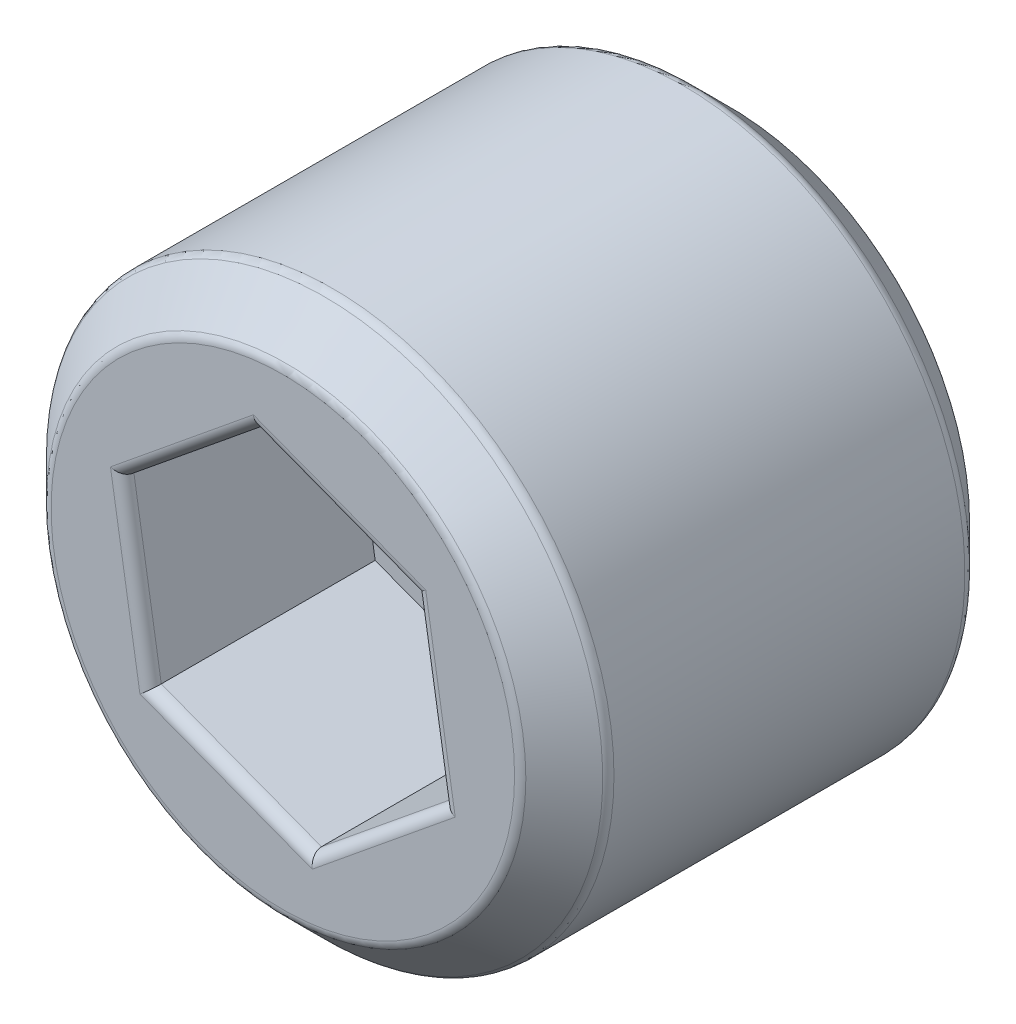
ISO-10303-21;
HEADER;
FILE_DESCRIPTION(('STEP AP214'),'2;1');
FILE_NAME('part.step','',(''),(''),'','','');
FILE_SCHEMA(('AUTOMOTIVE_DESIGN { 1 0 10303 214 1 1 1 1 }'));
ENDSEC;
DATA;
#1=APPLICATION_CONTEXT('core data for automotive mechanical design processes');
#2=APPLICATION_PROTOCOL_DEFINITION('international standard','automotive_design',2000,#1);
#3=PRODUCT_CONTEXT('',#1,'mechanical');
#4=PRODUCT('Part','Part','',(#3));
#5=PRODUCT_RELATED_PRODUCT_CATEGORY('part','',(#4));
#6=PRODUCT_DEFINITION_FORMATION('','',#4);
#7=PRODUCT_DEFINITION_CONTEXT('part definition',#1,'design');
#8=PRODUCT_DEFINITION('design','',#6,#7);
#9=PRODUCT_DEFINITION_SHAPE('','',#8);
#10=(LENGTH_UNIT() NAMED_UNIT(*) SI_UNIT(.MILLI.,.METRE.));
#11=(NAMED_UNIT(*) PLANE_ANGLE_UNIT() SI_UNIT($,.RADIAN.));
#12=(NAMED_UNIT(*) SI_UNIT($,.STERADIAN.) SOLID_ANGLE_UNIT());
#13=UNCERTAINTY_MEASURE_WITH_UNIT(LENGTH_MEASURE(1.E-05),#10,'distance_accuracy_value','');
#14=(GEOMETRIC_REPRESENTATION_CONTEXT(3) GLOBAL_UNCERTAINTY_ASSIGNED_CONTEXT((#13)) GLOBAL_UNIT_ASSIGNED_CONTEXT((#10,
#11,#12)) REPRESENTATION_CONTEXT('',''));
#15=CARTESIAN_POINT('',(0.,0.,0.));
#16=DIRECTION('',(0.,0.,1.));
#17=DIRECTION('',(1.,0.,0.));
#18=AXIS2_PLACEMENT_3D('',#15,#16,#17);
#19=CARTESIAN_POINT('',(0.,0.,4.));
#20=DIRECTION('',(0.,0.,-1.));
#21=DIRECTION('',(-1.,0.,0.));
#22=AXIS2_PLACEMENT_3D('',#19,#20,#21);
#23=CYLINDRICAL_SURFACE('',#22,2.5);
#24=CARTESIAN_POINT('',(0.,0.,3.55857864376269));
#25=DIRECTION('',(0.,0.,1.));
#26=DIRECTION('',(1.,0.,0.));
#27=AXIS2_PLACEMENT_3D('',#24,#25,#26);
#28=CIRCLE('',#27,2.5);
#29=CARTESIAN_POINT('',(2.5,0.,3.55857864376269));
#30=VERTEX_POINT('',#29);
#31=EDGE_CURVE('E11',#30,#30,#28,.F.);
#32=ORIENTED_EDGE('',*,*,#31,.T.);
#33=EDGE_LOOP('',(#32));
#34=FACE_BOUND('',#33,.T.);
#35=CARTESIAN_POINT('',(0.,0.,0.44142135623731));
#36=DIRECTION('',(0.,0.,-1.));
#37=DIRECTION('',(-1.,0.,0.));
#38=AXIS2_PLACEMENT_3D('',#35,#36,#37);
#39=CIRCLE('',#38,2.5);
#40=CARTESIAN_POINT('',(-2.5,0.,0.44142135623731));
#41=VERTEX_POINT('',#40);
#42=EDGE_CURVE('E42',#41,#41,#39,.F.);
#43=ORIENTED_EDGE('',*,*,#42,.T.);
#44=EDGE_LOOP('',(#43));
#45=FACE_BOUND('',#44,.T.);
#46=ADVANCED_FACE('F35',(#34,#45),#23,.T.);
#47=CARTESIAN_POINT('',(0.,0.,4.));
#48=DIRECTION('',(0.,0.,1.));
#49=DIRECTION('',(1.,0.,0.));
#50=AXIS2_PLACEMENT_3D('',#47,#48,#49);
#51=PLANE('',#50);
#52=CARTESIAN_POINT('',(0.,0.,4.));
#53=DIRECTION('',(0.,0.,1.));
#54=DIRECTION('',(1.,0.,0.));
#55=AXIS2_PLACEMENT_3D('',#52,#53,#54);
#56=CIRCLE('',#55,2.05857864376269);
#57=CARTESIAN_POINT('',(2.05857864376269,0.,4.));
#58=VERTEX_POINT('',#57);
#59=EDGE_CURVE('E178',#58,#58,#56,.T.);
#60=ORIENTED_EDGE('',*,*,#59,.T.);
#61=EDGE_LOOP('',(#60));
#62=FACE_BOUND('',#61,.T.);
#63=DIRECTION('',(0.159886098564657,-0.987135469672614,0.));
#64=VECTOR('',#63,1.);
#65=CARTESIAN_POINT('',(-1.52197446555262,0.524649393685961,4.));
#66=LINE('',#65,#64);
#67=CARTESIAN_POINT('',(-1.26931922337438,-1.03524201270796,4.));
#68=VERTEX_POINT('',#67);
#69=CARTESIAN_POINT('',(-1.53120549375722,0.581641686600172,4.));
#70=VERTEX_POINT('',#69);
#71=EDGE_CURVE('E173',#68,#70,#66,.F.);
#72=ORIENTED_EDGE('',*,*,#71,.T.);
#73=DIRECTION('',(-0.774941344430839,-0.632033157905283,0.));
#74=VECTOR('',#73,1.);
#75=CARTESIAN_POINT('',(-0.306627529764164,1.58039324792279,4.));
#76=LINE('',#75,#74);
#77=CARTESIAN_POINT('',(-0.261886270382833,1.61688369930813,4.));
#78=VERTEX_POINT('',#77);
#79=EDGE_CURVE('E175',#70,#78,#76,.F.);
#80=ORIENTED_EDGE('',*,*,#79,.T.);
#81=DIRECTION('',(-0.934827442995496,0.355102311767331,0.));
#82=VECTOR('',#81,1.);
#83=CARTESIAN_POINT('',(1.21534693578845,1.05574385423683,4.));
#84=LINE('',#83,#82);
#85=CARTESIAN_POINT('',(1.26931922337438,1.03524201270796,4.));
#86=VERTEX_POINT('',#85);
#87=EDGE_CURVE('E165',#78,#86,#84,.F.);
#88=ORIENTED_EDGE('',*,*,#87,.T.);
#89=DIRECTION('',(-0.159886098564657,0.987135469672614,0.));
#90=VECTOR('',#89,1.);
#91=CARTESIAN_POINT('',(1.52197446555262,-0.524649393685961,4.));
#92=LINE('',#91,#90);
#93=CARTESIAN_POINT('',(1.53120549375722,-0.581641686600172,4.));
#94=VERTEX_POINT('',#93);
#95=EDGE_CURVE('E167',#86,#94,#92,.F.);
#96=ORIENTED_EDGE('',*,*,#95,.T.);
#97=DIRECTION('',(0.774941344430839,0.632033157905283,0.));
#98=VECTOR('',#97,1.);
#99=CARTESIAN_POINT('',(0.306627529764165,-1.58039324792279,4.));
#100=LINE('',#99,#98);
#101=CARTESIAN_POINT('',(0.261886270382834,-1.61688369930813,4.));
#102=VERTEX_POINT('',#101);
#103=EDGE_CURVE('E169',#94,#102,#100,.F.);
#104=ORIENTED_EDGE('',*,*,#103,.T.);
#105=DIRECTION('',(0.934827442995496,-0.355102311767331,0.));
#106=VECTOR('',#105,1.);
#107=CARTESIAN_POINT('',(-1.21534693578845,-1.05574385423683,4.));
#108=LINE('',#107,#106);
#109=EDGE_CURVE('E171',#102,#68,#108,.F.);
#110=ORIENTED_EDGE('',*,*,#109,.T.);
#111=EDGE_LOOP('',(#72,#80,#88,#96,#104,#110));
#112=FACE_BOUND('',#111,.T.);
#113=ADVANCED_FACE('F212',(#62,#112),#51,.T.);
#114=CARTESIAN_POINT('',(0.,0.,0.));
#115=DIRECTION('',(0.,0.,1.));
#116=DIRECTION('',(1.,0.,0.));
#117=AXIS2_PLACEMENT_3D('',#114,#115,#116);
#118=PLANE('',#117);
#119=CARTESIAN_POINT('',(0.,0.,0.));
#120=DIRECTION('',(0.,0.,1.));
#121=DIRECTION('',(1.,0.,0.));
#122=AXIS2_PLACEMENT_3D('',#119,#120,#121);
#123=CIRCLE('',#122,2.05857864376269);
#124=CARTESIAN_POINT('',(2.05857864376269,0.,0.));
#125=VERTEX_POINT('',#124);
#126=EDGE_CURVE('E148',#125,#125,#123,.F.);
#127=ORIENTED_EDGE('',*,*,#126,.T.);
#128=EDGE_LOOP('',(#127));
#129=FACE_BOUND('',#128,.T.);
#130=ADVANCED_FACE('F217',(#129),#118,.F.);
#131=CARTESIAN_POINT('',(0.,0.,0.400000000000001));
#132=DIRECTION('',(0.,0.,1.));
#133=DIRECTION('',(1.,0.,0.));
#134=AXIS2_PLACEMENT_3D('',#131,#132,#133);
#135=CONICAL_SURFACE('',#134,2.5,0.78539816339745);
#136=CARTESIAN_POINT('',(0.,0.,0.029289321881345));
#137=DIRECTION('',(0.,0.,1.));
#138=DIRECTION('',(1.,0.,0.));
#139=AXIS2_PLACEMENT_3D('',#136,#137,#138);
#140=CIRCLE('',#139,2.12928932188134);
#141=CARTESIAN_POINT('',(2.12928932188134,0.,0.029289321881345));
#142=VERTEX_POINT('',#141);
#143=EDGE_CURVE('E162',#142,#142,#140,.T.);
#144=ORIENTED_EDGE('',*,*,#143,.T.);
#145=EDGE_LOOP('',(#144));
#146=FACE_BOUND('',#145,.T.);
#147=CARTESIAN_POINT('',(0.,0.,0.370710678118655));
#148=DIRECTION('',(0.,0.,1.));
#149=DIRECTION('',(1.,0.,0.));
#150=AXIS2_PLACEMENT_3D('',#147,#148,#149);
#151=CIRCLE('',#150,2.47071067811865);
#152=CARTESIAN_POINT('',(2.47071067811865,0.,0.370710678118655));
#153=VERTEX_POINT('',#152);
#154=EDGE_CURVE('E159',#153,#153,#151,.F.);
#155=ORIENTED_EDGE('',*,*,#154,.T.);
#156=EDGE_LOOP('',(#155));
#157=FACE_BOUND('',#156,.T.);
#158=ADVANCED_FACE('F224',(#146,#157),#135,.T.);
#159=CARTESIAN_POINT('',(0.,0.,4.));
#160=DIRECTION('',(0.,0.,-1.));
#161=DIRECTION('',(-1.,0.,0.));
#162=AXIS2_PLACEMENT_3D('',#159,#160,#161);
#163=CONICAL_SURFACE('',#162,2.1,0.785398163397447);
#164=CARTESIAN_POINT('',(0.,0.,3.97071067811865));
#165=DIRECTION('',(0.,0.,1.));
#166=DIRECTION('',(1.,0.,0.));
#167=AXIS2_PLACEMENT_3D('',#164,#165,#166);
#168=CIRCLE('',#167,2.12928932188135);
#169=CARTESIAN_POINT('',(2.12928932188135,0.,3.97071067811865));
#170=VERTEX_POINT('',#169);
#171=EDGE_CURVE('E184',#170,#170,#168,.F.);
#172=ORIENTED_EDGE('',*,*,#171,.T.);
#173=EDGE_LOOP('',(#172));
#174=FACE_BOUND('',#173,.T.);
#175=CARTESIAN_POINT('',(0.,0.,3.62928932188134));
#176=DIRECTION('',(0.,0.,-1.));
#177=DIRECTION('',(-1.,0.,0.));
#178=AXIS2_PLACEMENT_3D('',#175,#176,#177);
#179=CIRCLE('',#178,2.47071067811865);
#180=CARTESIAN_POINT('',(-2.47071067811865,0.,3.62928932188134));
#181=VERTEX_POINT('',#180);
#182=EDGE_CURVE('E181',#181,#181,#179,.F.);
#183=ORIENTED_EDGE('',*,*,#182,.T.);
#184=EDGE_LOOP('',(#183));
#185=FACE_BOUND('',#184,.T.);
#186=ADVANCED_FACE('F231',(#174,#185),#163,.T.);
#187=CARTESIAN_POINT('',(1.17983670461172,0.962261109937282,2.));
#188=DIRECTION('',(0.355102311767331,0.934827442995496,0.));
#189=DIRECTION('',(-0.934827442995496,0.355102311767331,0.));
#190=AXIS2_PLACEMENT_3D('',#187,#188,#189);
#191=PLANE('',#190);
#192=DIRECTION('',(0.,0.,1.));
#193=VECTOR('',#192,1.);
#194=CARTESIAN_POINT('',(1.17983670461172,0.962261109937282,2.));
#195=LINE('',#194,#193);
#196=CARTESIAN_POINT('',(1.17983670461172,0.962261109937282,2.));
#197=VERTEX_POINT('',#196);
#198=CARTESIAN_POINT('',(1.17983670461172,0.962261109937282,3.9));
#199=VERTEX_POINT('',#198);
#200=EDGE_CURVE('E146',#197,#199,#195,.T.);
#201=ORIENTED_EDGE('',*,*,#200,.T.);
#202=DIRECTION('',(-0.934827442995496,0.355102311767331,0.));
#203=VECTOR('',#202,1.);
#204=CARTESIAN_POINT('',(-0.243424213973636,1.50289911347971,3.9));
#205=LINE('',#204,#203);
#206=CARTESIAN_POINT('',(-0.243424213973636,1.50289911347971,3.9));
#207=VERTEX_POINT('',#206);
#208=EDGE_CURVE('E113',#199,#207,#205,.T.);
#209=ORIENTED_EDGE('',*,*,#208,.T.);
#210=DIRECTION('',(0.,0.,1.));
#211=VECTOR('',#210,1.);
#212=CARTESIAN_POINT('',(-0.243424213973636,1.50289911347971,2.));
#213=LINE('',#212,#211);
#214=CARTESIAN_POINT('',(-0.243424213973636,1.50289911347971,2.));
#215=VERTEX_POINT('',#214);
#216=EDGE_CURVE('E106',#215,#207,#213,.T.);
#217=ORIENTED_EDGE('',*,*,#216,.F.);
#218=DIRECTION('',(-0.934827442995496,0.355102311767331,0.));
#219=VECTOR('',#218,1.);
#220=CARTESIAN_POINT('',(1.17983670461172,0.962261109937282,2.));
#221=LINE('',#220,#219);
#222=EDGE_CURVE('E110',#197,#215,#221,.T.);
#223=ORIENTED_EDGE('',*,*,#222,.F.);
#224=EDGE_LOOP('',(#201,#209,#217,#223));
#225=FACE_BOUND('',#224,.T.);
#226=ADVANCED_FACE('F108',(#225),#191,.F.);
#227=CARTESIAN_POINT('',(1.42326091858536,-0.540638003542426,2.));
#228=DIRECTION('',(0.987135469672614,0.159886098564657,0.));
#229=DIRECTION('',(-0.159886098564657,0.987135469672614,0.));
#230=AXIS2_PLACEMENT_3D('',#227,#228,#229);
#231=PLANE('',#230);
#232=DIRECTION('',(0.,0.,1.));
#233=VECTOR('',#232,1.);
#234=CARTESIAN_POINT('',(1.42326091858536,-0.540638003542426,2.));
#235=LINE('',#234,#233);
#236=CARTESIAN_POINT('',(1.42326091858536,-0.540638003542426,2.));
#237=VERTEX_POINT('',#236);
#238=CARTESIAN_POINT('',(1.42326091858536,-0.540638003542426,3.9));
#239=VERTEX_POINT('',#238);
#240=EDGE_CURVE('E149',#237,#239,#235,.T.);
#241=ORIENTED_EDGE('',*,*,#240,.T.);
#242=DIRECTION('',(-0.159886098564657,0.987135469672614,0.));
#243=VECTOR('',#242,1.);
#244=CARTESIAN_POINT('',(1.17983670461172,0.962261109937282,3.9));
#245=LINE('',#244,#243);
#246=EDGE_CURVE('E49',#239,#199,#245,.T.);
#247=ORIENTED_EDGE('',*,*,#246,.T.);
#248=ORIENTED_EDGE('',*,*,#200,.F.);
#249=DIRECTION('',(-0.159886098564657,0.987135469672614,0.));
#250=VECTOR('',#249,1.);
#251=CARTESIAN_POINT('',(1.42326091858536,-0.540638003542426,2.));
#252=LINE('',#251,#250);
#253=EDGE_CURVE('E118',#237,#197,#252,.T.);
#254=ORIENTED_EDGE('',*,*,#253,.F.);
#255=EDGE_LOOP('',(#241,#247,#248,#254));
#256=FACE_BOUND('',#255,.T.);
#257=ADVANCED_FACE('F238',(#256),#231,.F.);
#258=CARTESIAN_POINT('',(0.243424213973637,-1.50289911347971,2.));
#259=DIRECTION('',(0.632033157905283,-0.774941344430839,0.));
#260=DIRECTION('',(0.774941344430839,0.632033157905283,0.));
#261=AXIS2_PLACEMENT_3D('',#258,#259,#260);
#262=PLANE('',#261);
#263=DIRECTION('',(0.,0.,1.));
#264=VECTOR('',#263,1.);
#265=CARTESIAN_POINT('',(0.243424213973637,-1.50289911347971,2.));
#266=LINE('',#265,#264);
#267=CARTESIAN_POINT('',(0.243424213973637,-1.50289911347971,2.));
#268=VERTEX_POINT('',#267);
#269=CARTESIAN_POINT('',(0.243424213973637,-1.50289911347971,3.9));
#270=VERTEX_POINT('',#269);
#271=EDGE_CURVE('E151',#268,#270,#266,.T.);
#272=ORIENTED_EDGE('',*,*,#271,.T.);
#273=DIRECTION('',(0.774941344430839,0.632033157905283,0.));
#274=VECTOR('',#273,1.);
#275=CARTESIAN_POINT('',(1.42326091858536,-0.540638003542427,3.9));
#276=LINE('',#275,#274);
#277=EDGE_CURVE('E57',#270,#239,#276,.T.);
#278=ORIENTED_EDGE('',*,*,#277,.T.);
#279=ORIENTED_EDGE('',*,*,#240,.F.);
#280=DIRECTION('',(0.774941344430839,0.632033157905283,0.));
#281=VECTOR('',#280,1.);
#282=CARTESIAN_POINT('',(0.243424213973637,-1.50289911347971,2.));
#283=LINE('',#282,#281);
#284=EDGE_CURVE('E143',#268,#237,#283,.T.);
#285=ORIENTED_EDGE('',*,*,#284,.F.);
#286=EDGE_LOOP('',(#272,#278,#279,#285));
#287=FACE_BOUND('',#286,.T.);
#288=ADVANCED_FACE('F248',(#287),#262,.F.);
#289=CARTESIAN_POINT('',(-1.17983670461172,-0.962261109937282,2.));
#290=DIRECTION('',(-0.355102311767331,-0.934827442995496,0.));
#291=DIRECTION('',(0.934827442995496,-0.355102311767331,0.));
#292=AXIS2_PLACEMENT_3D('',#289,#290,#291);
#293=PLANE('',#292);
#294=DIRECTION('',(0.,0.,1.));
#295=VECTOR('',#294,1.);
#296=CARTESIAN_POINT('',(-1.17983670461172,-0.962261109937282,2.));
#297=LINE('',#296,#295);
#298=CARTESIAN_POINT('',(-1.17983670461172,-0.962261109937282,2.));
#299=VERTEX_POINT('',#298);
#300=CARTESIAN_POINT('',(-1.17983670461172,-0.962261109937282,3.9));
#301=VERTEX_POINT('',#300);
#302=EDGE_CURVE('E153',#299,#301,#297,.T.);
#303=ORIENTED_EDGE('',*,*,#302,.T.);
#304=DIRECTION('',(0.934827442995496,-0.355102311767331,0.));
#305=VECTOR('',#304,1.);
#306=CARTESIAN_POINT('',(0.243424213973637,-1.50289911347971,3.9));
#307=LINE('',#306,#305);
#308=EDGE_CURVE('E191',#301,#270,#307,.T.);
#309=ORIENTED_EDGE('',*,*,#308,.T.);
#310=ORIENTED_EDGE('',*,*,#271,.F.);
#311=DIRECTION('',(0.934827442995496,-0.355102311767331,0.));
#312=VECTOR('',#311,1.);
#313=CARTESIAN_POINT('',(-1.17983670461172,-0.962261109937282,2.));
#314=LINE('',#313,#312);
#315=EDGE_CURVE('E140',#299,#268,#314,.T.);
#316=ORIENTED_EDGE('',*,*,#315,.F.);
#317=EDGE_LOOP('',(#303,#309,#310,#316));
#318=FACE_BOUND('',#317,.T.);
#319=ADVANCED_FACE('F244',(#318),#293,.F.);
#320=CARTESIAN_POINT('',(-1.42326091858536,0.540638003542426,2.));
#321=DIRECTION('',(-0.987135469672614,-0.159886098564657,0.));
#322=DIRECTION('',(0.159886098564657,-0.987135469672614,0.));
#323=AXIS2_PLACEMENT_3D('',#320,#321,#322);
#324=PLANE('',#323);
#325=DIRECTION('',(0.,0.,1.));
#326=VECTOR('',#325,1.);
#327=CARTESIAN_POINT('',(-1.42326091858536,0.540638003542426,2.));
#328=LINE('',#327,#326);
#329=CARTESIAN_POINT('',(-1.42326091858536,0.540638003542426,2.));
#330=VERTEX_POINT('',#329);
#331=CARTESIAN_POINT('',(-1.42326091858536,0.540638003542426,3.9));
#332=VERTEX_POINT('',#331);
#333=EDGE_CURVE('E117',#330,#332,#328,.T.);
#334=ORIENTED_EDGE('',*,*,#333,.T.);
#335=DIRECTION('',(0.159886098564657,-0.987135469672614,0.));
#336=VECTOR('',#335,1.);
#337=CARTESIAN_POINT('',(-1.17983670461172,-0.962261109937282,3.9));
#338=LINE('',#337,#336);
#339=EDGE_CURVE('E189',#332,#301,#338,.T.);
#340=ORIENTED_EDGE('',*,*,#339,.T.);
#341=ORIENTED_EDGE('',*,*,#302,.F.);
#342=DIRECTION('',(0.159886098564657,-0.987135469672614,0.));
#343=VECTOR('',#342,1.);
#344=CARTESIAN_POINT('',(-1.42326091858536,0.540638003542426,2.));
#345=LINE('',#344,#343);
#346=EDGE_CURVE('E127',#330,#299,#345,.T.);
#347=ORIENTED_EDGE('',*,*,#346,.F.);
#348=EDGE_LOOP('',(#334,#340,#341,#347));
#349=FACE_BOUND('',#348,.T.);
#350=ADVANCED_FACE('F241',(#349),#324,.F.);
#351=CARTESIAN_POINT('',(-0.243424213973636,1.50289911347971,2.));
#352=DIRECTION('',(-0.632033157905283,0.774941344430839,0.));
#353=DIRECTION('',(-0.774941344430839,-0.632033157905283,0.));
#354=AXIS2_PLACEMENT_3D('',#351,#352,#353);
#355=PLANE('',#354);
#356=ORIENTED_EDGE('',*,*,#216,.T.);
#357=DIRECTION('',(-0.774941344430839,-0.632033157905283,0.));
#358=VECTOR('',#357,1.);
#359=CARTESIAN_POINT('',(-1.42326091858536,0.540638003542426,3.9));
#360=LINE('',#359,#358);
#361=EDGE_CURVE('E187',#207,#332,#360,.T.);
#362=ORIENTED_EDGE('',*,*,#361,.T.);
#363=ORIENTED_EDGE('',*,*,#333,.F.);
#364=DIRECTION('',(-0.774941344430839,-0.632033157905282,0.));
#365=VECTOR('',#364,1.);
#366=CARTESIAN_POINT('',(-0.243424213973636,1.50289911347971,2.));
#367=LINE('',#366,#365);
#368=EDGE_CURVE('E121',#215,#330,#367,.T.);
#369=ORIENTED_EDGE('',*,*,#368,.F.);
#370=EDGE_LOOP('',(#356,#362,#363,#369));
#371=FACE_BOUND('',#370,.T.);
#372=ADVANCED_FACE('F122',(#371),#355,.F.);
#373=CARTESIAN_POINT('',(1.17983670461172,0.962261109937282,2.));
#374=DIRECTION('',(0.,0.,-1.));
#375=DIRECTION('',(-1.,0.,0.));
#376=AXIS2_PLACEMENT_3D('',#373,#374,#375);
#377=PLANE('',#376);
#378=ORIENTED_EDGE('',*,*,#222,.T.);
#379=ORIENTED_EDGE('',*,*,#368,.T.);
#380=ORIENTED_EDGE('',*,*,#346,.T.);
#381=ORIENTED_EDGE('',*,*,#315,.T.);
#382=ORIENTED_EDGE('',*,*,#284,.T.);
#383=ORIENTED_EDGE('',*,*,#253,.T.);
#384=EDGE_LOOP('',(#378,#379,#380,#381,#382,#383));
#385=FACE_BOUND('',#384,.T.);
#386=ADVANCED_FACE('F129',(#385),#377,.F.);
#387=CARTESIAN_POINT('',(0.,0.,0.1));
#388=DIRECTION('',(0.,0.,1.));
#389=DIRECTION('',(1.,0.,0.));
#390=AXIS2_PLACEMENT_3D('',#387,#388,#389);
#391=TOROIDAL_SURFACE('',#390,2.05857864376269,0.1);
#392=ORIENTED_EDGE('',*,*,#143,.F.);
#393=EDGE_LOOP('',(#392));
#394=FACE_BOUND('',#393,.T.);
#395=ORIENTED_EDGE('',*,*,#126,.F.);
#396=EDGE_LOOP('',(#395));
#397=FACE_BOUND('',#396,.T.);
#398=ADVANCED_FACE('F256',(#394,#397),#391,.T.);
#399=CARTESIAN_POINT('',(0.,0.,3.9));
#400=DIRECTION('',(0.,0.,1.));
#401=DIRECTION('',(1.,0.,0.));
#402=AXIS2_PLACEMENT_3D('',#399,#400,#401);
#403=TOROIDAL_SURFACE('',#402,2.05857864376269,0.1);
#404=ORIENTED_EDGE('',*,*,#171,.F.);
#405=EDGE_LOOP('',(#404));
#406=FACE_BOUND('',#405,.T.);
#407=ORIENTED_EDGE('',*,*,#59,.F.);
#408=EDGE_LOOP('',(#407));
#409=FACE_BOUND('',#408,.T.);
#410=ADVANCED_FACE('F259',(#406,#409),#403,.T.);
#411=CARTESIAN_POINT('',(0.306627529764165,-1.58039324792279,3.9));
#412=DIRECTION('',(-0.774941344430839,-0.632033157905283,0.));
#413=DIRECTION('',(0.632033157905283,-0.774941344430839,0.));
#414=AXIS2_PLACEMENT_3D('',#411,#412,#413);
#415=CYLINDRICAL_SURFACE('',#414,0.1);
#416=CARTESIAN_POINT('',(0.261886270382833,-1.61688369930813,3.9));
#417=DIRECTION('',(-0.987135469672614,-0.159886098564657,0.));
#418=DIRECTION('',(-0.159886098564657,0.987135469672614,0.));
#419=AXIS2_PLACEMENT_3D('',#416,#417,#418);
#420=ELLIPSE('',#419,0.115470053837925,0.1);
#421=EDGE_CURVE('E135',#102,#270,#420,.T.);
#422=ORIENTED_EDGE('',*,*,#421,.F.);
#423=ORIENTED_EDGE('',*,*,#103,.F.);
#424=CARTESIAN_POINT('',(1.53120549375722,-0.581641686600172,3.9));
#425=DIRECTION('',(-0.355102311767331,-0.934827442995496,0.));
#426=DIRECTION('',(-0.934827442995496,0.355102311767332,0.));
#427=AXIS2_PLACEMENT_3D('',#424,#425,#426);
#428=ELLIPSE('',#427,0.115470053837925,0.1);
#429=EDGE_CURVE('E132',#239,#94,#428,.F.);
#430=ORIENTED_EDGE('',*,*,#429,.F.);
#431=ORIENTED_EDGE('',*,*,#277,.F.);
#432=EDGE_LOOP('',(#422,#423,#430,#431));
#433=FACE_BOUND('',#432,.T.);
#434=ADVANCED_FACE('F263',(#433),#415,.T.);
#435=CARTESIAN_POINT('',(1.52197446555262,-0.524649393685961,3.9));
#436=DIRECTION('',(0.159886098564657,-0.987135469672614,0.));
#437=DIRECTION('',(0.987135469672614,0.159886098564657,0.));
#438=AXIS2_PLACEMENT_3D('',#435,#436,#437);
#439=CYLINDRICAL_SURFACE('',#438,0.1);
#440=ORIENTED_EDGE('',*,*,#429,.T.);
#441=ORIENTED_EDGE('',*,*,#95,.F.);
#442=CARTESIAN_POINT('',(1.26931922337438,1.03524201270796,3.9));
#443=DIRECTION('',(0.632033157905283,-0.774941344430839,0.));
#444=DIRECTION('',(-0.774941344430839,-0.632033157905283,0.));
#445=AXIS2_PLACEMENT_3D('',#442,#443,#444);
#446=ELLIPSE('',#445,0.115470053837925,0.1);
#447=EDGE_CURVE('E298',#199,#86,#446,.F.);
#448=ORIENTED_EDGE('',*,*,#447,.F.);
#449=ORIENTED_EDGE('',*,*,#246,.F.);
#450=EDGE_LOOP('',(#440,#441,#448,#449));
#451=FACE_BOUND('',#450,.T.);
#452=ADVANCED_FACE('F267',(#451),#439,.T.);
#453=CARTESIAN_POINT('',(-1.21534693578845,-1.05574385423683,3.9));
#454=DIRECTION('',(-0.934827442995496,0.355102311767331,0.));
#455=DIRECTION('',(-0.355102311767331,-0.934827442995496,0.));
#456=AXIS2_PLACEMENT_3D('',#453,#454,#455);
#457=CYLINDRICAL_SURFACE('',#456,0.1);
#458=ORIENTED_EDGE('',*,*,#421,.T.);
#459=ORIENTED_EDGE('',*,*,#308,.F.);
#460=CARTESIAN_POINT('',(-1.26931922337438,-1.03524201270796,3.9));
#461=DIRECTION('',(-0.632033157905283,0.774941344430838,0.));
#462=DIRECTION('',(0.774941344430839,0.632033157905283,0.));
#463=AXIS2_PLACEMENT_3D('',#460,#461,#462);
#464=ELLIPSE('',#463,0.115470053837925,0.1);
#465=EDGE_CURVE('E293',#68,#301,#464,.T.);
#466=ORIENTED_EDGE('',*,*,#465,.F.);
#467=ORIENTED_EDGE('',*,*,#109,.F.);
#468=EDGE_LOOP('',(#458,#459,#466,#467));
#469=FACE_BOUND('',#468,.T.);
#470=ADVANCED_FACE('F271',(#469),#457,.T.);
#471=CARTESIAN_POINT('',(1.21534693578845,1.05574385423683,3.9));
#472=DIRECTION('',(0.934827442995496,-0.355102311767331,0.));
#473=DIRECTION('',(0.355102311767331,0.934827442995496,0.));
#474=AXIS2_PLACEMENT_3D('',#471,#472,#473);
#475=CYLINDRICAL_SURFACE('',#474,0.1);
#476=ORIENTED_EDGE('',*,*,#447,.T.);
#477=ORIENTED_EDGE('',*,*,#87,.F.);
#478=CARTESIAN_POINT('',(-0.261886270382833,1.61688369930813,3.9));
#479=DIRECTION('',(0.987135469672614,0.159886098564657,0.));
#480=DIRECTION('',(-0.159886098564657,0.987135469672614,0.));
#481=AXIS2_PLACEMENT_3D('',#478,#479,#480);
#482=ELLIPSE('',#481,0.115470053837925,0.1);
#483=EDGE_CURVE('E290',#207,#78,#482,.F.);
#484=ORIENTED_EDGE('',*,*,#483,.F.);
#485=ORIENTED_EDGE('',*,*,#208,.F.);
#486=EDGE_LOOP('',(#476,#477,#484,#485));
#487=FACE_BOUND('',#486,.T.);
#488=ADVANCED_FACE('F275',(#487),#475,.T.);
#489=CARTESIAN_POINT('',(-1.52197446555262,0.524649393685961,3.9));
#490=DIRECTION('',(-0.159886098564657,0.987135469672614,0.));
#491=DIRECTION('',(-0.987135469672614,-0.159886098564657,0.));
#492=AXIS2_PLACEMENT_3D('',#489,#490,#491);
#493=CYLINDRICAL_SURFACE('',#492,0.1);
#494=ORIENTED_EDGE('',*,*,#465,.T.);
#495=ORIENTED_EDGE('',*,*,#339,.F.);
#496=CARTESIAN_POINT('',(-1.53120549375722,0.581641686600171,3.9));
#497=DIRECTION('',(0.355102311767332,0.934827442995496,0.));
#498=DIRECTION('',(0.934827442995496,-0.355102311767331,0.));
#499=AXIS2_PLACEMENT_3D('',#496,#497,#498);
#500=ELLIPSE('',#499,0.115470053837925,0.1);
#501=EDGE_CURVE('E294',#70,#332,#500,.T.);
#502=ORIENTED_EDGE('',*,*,#501,.F.);
#503=ORIENTED_EDGE('',*,*,#71,.F.);
#504=EDGE_LOOP('',(#494,#495,#502,#503));
#505=FACE_BOUND('',#504,.T.);
#506=ADVANCED_FACE('F279',(#505),#493,.T.);
#507=CARTESIAN_POINT('',(-0.306627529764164,1.58039324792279,3.9));
#508=DIRECTION('',(0.774941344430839,0.632033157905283,0.));
#509=DIRECTION('',(-0.632033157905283,0.774941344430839,0.));
#510=AXIS2_PLACEMENT_3D('',#507,#508,#509);
#511=CYLINDRICAL_SURFACE('',#510,0.1);
#512=ORIENTED_EDGE('',*,*,#483,.T.);
#513=ORIENTED_EDGE('',*,*,#79,.F.);
#514=ORIENTED_EDGE('',*,*,#501,.T.);
#515=ORIENTED_EDGE('',*,*,#361,.F.);
#516=EDGE_LOOP('',(#512,#513,#514,#515));
#517=FACE_BOUND('',#516,.T.);
#518=ADVANCED_FACE('F207',(#517),#511,.T.);
#519=CARTESIAN_POINT('',(0.,0.,3.55857864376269));
#520=DIRECTION('',(0.,0.,1.));
#521=DIRECTION('',(1.,0.,0.));
#522=AXIS2_PLACEMENT_3D('',#519,#520,#521);
#523=TOROIDAL_SURFACE('',#522,2.4,0.1);
#524=ORIENTED_EDGE('',*,*,#182,.F.);
#525=EDGE_LOOP('',(#524));
#526=FACE_BOUND('',#525,.T.);
#527=ORIENTED_EDGE('',*,*,#31,.F.);
#528=EDGE_LOOP('',(#527));
#529=FACE_BOUND('',#528,.T.);
#530=ADVANCED_FACE('F201',(#526,#529),#523,.T.);
#531=CARTESIAN_POINT('',(0.,0.,0.44142135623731));
#532=DIRECTION('',(0.,0.,-1.));
#533=DIRECTION('',(-1.,0.,0.));
#534=AXIS2_PLACEMENT_3D('',#531,#532,#533);
#535=TOROIDAL_SURFACE('',#534,2.4,0.1);
#536=ORIENTED_EDGE('',*,*,#154,.F.);
#537=EDGE_LOOP('',(#536));
#538=FACE_BOUND('',#537,.T.);
#539=ORIENTED_EDGE('',*,*,#42,.F.);
#540=EDGE_LOOP('',(#539));
#541=FACE_BOUND('',#540,.T.);
#542=ADVANCED_FACE('F199',(#538,#541),#535,.T.);
#543=CLOSED_SHELL('',(#46,#113,#130,#158,#186,#226,#257,#288,#319,#350,#372,#386,#398,#410,#434,
#452,#470,#488,#506,#518,#530,#542));
#544=MANIFOLD_SOLID_BREP('B2',#543);
#545=ADVANCED_BREP_SHAPE_REPRESENTATION('',(#18,#544),#14);
#546=SHAPE_DEFINITION_REPRESENTATION(#9,#545);
ENDSEC;
END-ISO-10303-21;
